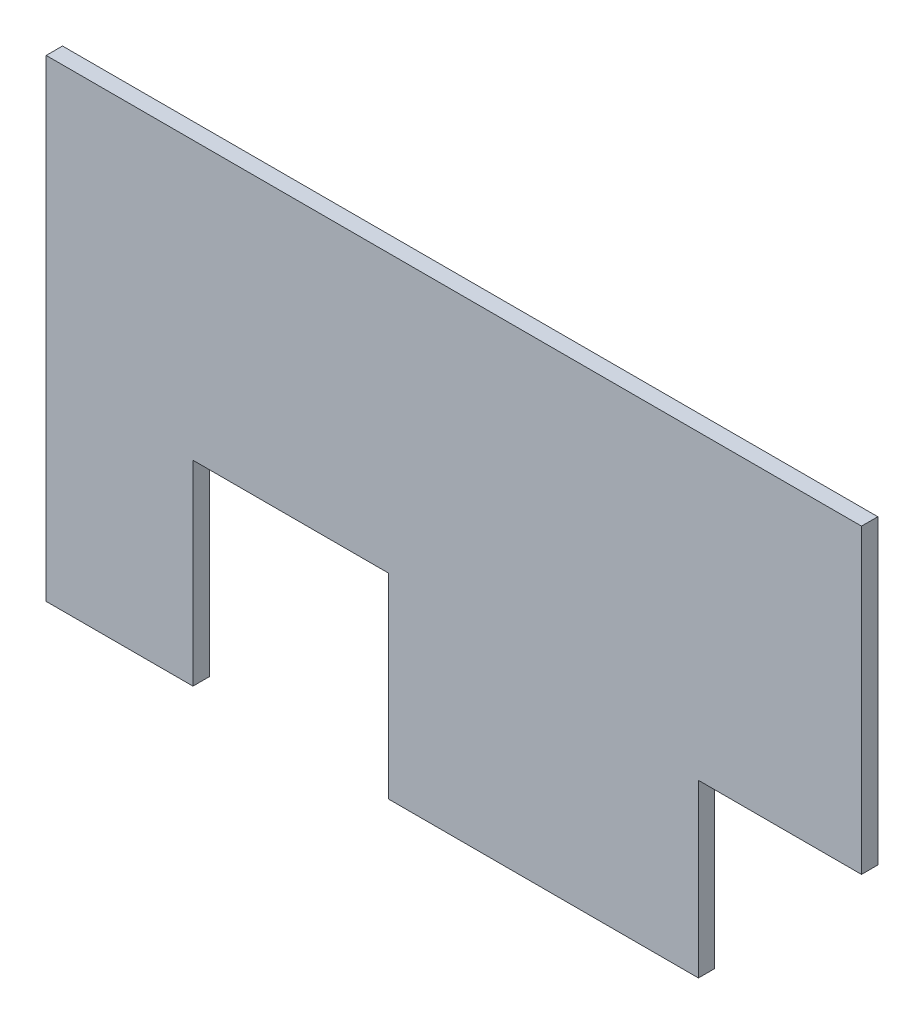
ISO-10303-21;
HEADER;
FILE_DESCRIPTION(('STEP AP214'),'2;1');
FILE_NAME('part.step','',(''),(''),'','','');
FILE_SCHEMA(('AUTOMOTIVE_DESIGN { 1 0 10303 214 1 1 1 1 }'));
ENDSEC;
DATA;
#1=APPLICATION_CONTEXT('core data for automotive mechanical design processes');
#2=APPLICATION_PROTOCOL_DEFINITION('international standard','automotive_design',2000,#1);
#3=PRODUCT_CONTEXT('',#1,'mechanical');
#4=PRODUCT('Part','Part','',(#3));
#5=PRODUCT_RELATED_PRODUCT_CATEGORY('part','',(#4));
#6=PRODUCT_DEFINITION_FORMATION('','',#4);
#7=PRODUCT_DEFINITION_CONTEXT('part definition',#1,'design');
#8=PRODUCT_DEFINITION('design','',#6,#7);
#9=PRODUCT_DEFINITION_SHAPE('','',#8);
#10=(LENGTH_UNIT() NAMED_UNIT(*) SI_UNIT(.MILLI.,.METRE.));
#11=(NAMED_UNIT(*) PLANE_ANGLE_UNIT() SI_UNIT($,.RADIAN.));
#12=(NAMED_UNIT(*) SI_UNIT($,.STERADIAN.) SOLID_ANGLE_UNIT());
#13=UNCERTAINTY_MEASURE_WITH_UNIT(LENGTH_MEASURE(1.E-05),#10,'distance_accuracy_value','');
#14=(GEOMETRIC_REPRESENTATION_CONTEXT(3) GLOBAL_UNCERTAINTY_ASSIGNED_CONTEXT((#13)) GLOBAL_UNIT_ASSIGNED_CONTEXT((#10,
#11,#12)) REPRESENTATION_CONTEXT('',''));
#15=CARTESIAN_POINT('',(0.,0.,0.));
#16=DIRECTION('',(0.,0.,1.));
#17=DIRECTION('',(1.,0.,0.));
#18=AXIS2_PLACEMENT_3D('',#15,#16,#17);
#19=CARTESIAN_POINT('',(0.,0.,1.));
#20=DIRECTION('',(0.,1.,0.));
#21=DIRECTION('',(0.,0.,1.));
#22=AXIS2_PLACEMENT_3D('',#19,#20,#21);
#23=PLANE('',#22);
#24=DIRECTION('',(1.,0.,0.));
#25=VECTOR('',#24,1.);
#26=CARTESIAN_POINT('',(0.,0.,0.));
#27=LINE('',#26,#25);
#28=CARTESIAN_POINT('',(0.,0.,0.));
#29=VERTEX_POINT('',#28);
#30=CARTESIAN_POINT('',(9.,0.,0.));
#31=VERTEX_POINT('',#30);
#32=EDGE_CURVE('E165',#29,#31,#27,.T.);
#33=ORIENTED_EDGE('',*,*,#32,.T.);
#34=DIRECTION('',(0.,0.,1.));
#35=VECTOR('',#34,1.);
#36=CARTESIAN_POINT('',(9.,0.,-0.5));
#37=LINE('',#36,#35);
#38=CARTESIAN_POINT('',(9.,0.,1.));
#39=VERTEX_POINT('',#38);
#40=EDGE_CURVE('E230',#31,#39,#37,.T.);
#41=ORIENTED_EDGE('',*,*,#40,.T.);
#42=DIRECTION('',(1.,0.,0.));
#43=VECTOR('',#42,1.);
#44=CARTESIAN_POINT('',(0.,0.,1.));
#45=LINE('',#44,#43);
#46=CARTESIAN_POINT('',(0.,0.,1.));
#47=VERTEX_POINT('',#46);
#48=EDGE_CURVE('E142',#47,#39,#45,.T.);
#49=ORIENTED_EDGE('',*,*,#48,.F.);
#50=DIRECTION('',(0.,0.,-1.));
#51=VECTOR('',#50,1.);
#52=CARTESIAN_POINT('',(0.,0.,1.));
#53=LINE('',#52,#51);
#54=EDGE_CURVE('E181',#47,#29,#53,.T.);
#55=ORIENTED_EDGE('',*,*,#54,.T.);
#56=EDGE_LOOP('',(#33,#41,#49,#55));
#57=FACE_BOUND('',#56,.T.);
#58=ADVANCED_FACE('F39',(#57),#23,.F.);
#59=CARTESIAN_POINT('',(0.,0.,1.));
#60=DIRECTION('',(1.,0.,0.));
#61=DIRECTION('',(0.,0.,-1.));
#62=AXIS2_PLACEMENT_3D('',#59,#60,#61);
#63=PLANE('',#62);
#64=DIRECTION('',(0.,-1.,0.));
#65=VECTOR('',#64,1.);
#66=CARTESIAN_POINT('',(0.,0.,0.));
#67=LINE('',#66,#65);
#68=CARTESIAN_POINT('',(0.,29.,0.));
#69=VERTEX_POINT('',#68);
#70=EDGE_CURVE('E160',#69,#29,#67,.T.);
#71=ORIENTED_EDGE('',*,*,#70,.T.);
#72=ORIENTED_EDGE('',*,*,#54,.F.);
#73=DIRECTION('',(0.,-1.,0.));
#74=VECTOR('',#73,1.);
#75=CARTESIAN_POINT('',(0.,0.,1.));
#76=LINE('',#75,#74);
#77=CARTESIAN_POINT('',(0.,29.,1.));
#78=VERTEX_POINT('',#77);
#79=EDGE_CURVE('E143',#78,#47,#76,.T.);
#80=ORIENTED_EDGE('',*,*,#79,.F.);
#81=DIRECTION('',(0.,0.,-1.));
#82=VECTOR('',#81,1.);
#83=CARTESIAN_POINT('',(0.,29.,1.));
#84=LINE('',#83,#82);
#85=EDGE_CURVE('E159',#78,#69,#84,.T.);
#86=ORIENTED_EDGE('',*,*,#85,.T.);
#87=EDGE_LOOP('',(#71,#72,#80,#86));
#88=FACE_BOUND('',#87,.T.);
#89=ADVANCED_FACE('F41',(#88),#63,.F.);
#90=CARTESIAN_POINT('',(21.,0.,0.));
#91=VERTEX_POINT('',#90);
#92=CARTESIAN_POINT('',(40.,0.,0.));
#93=VERTEX_POINT('',#92);
#94=EDGE_CURVE('E133',#91,#93,#27,.T.);
#95=ORIENTED_EDGE('',*,*,#94,.T.);
#96=DIRECTION('',(0.,0.,1.));
#97=VECTOR('',#96,1.);
#98=CARTESIAN_POINT('',(40.,0.,-0.5));
#99=LINE('',#98,#97);
#100=CARTESIAN_POINT('',(40.,0.,1.));
#101=VERTEX_POINT('',#100);
#102=EDGE_CURVE('E118',#93,#101,#99,.T.);
#103=ORIENTED_EDGE('',*,*,#102,.T.);
#104=CARTESIAN_POINT('',(21.,0.,1.));
#105=VERTEX_POINT('',#104);
#106=EDGE_CURVE('E131',#105,#101,#45,.T.);
#107=ORIENTED_EDGE('',*,*,#106,.F.);
#108=DIRECTION('',(0.,0.,1.));
#109=VECTOR('',#108,1.);
#110=CARTESIAN_POINT('',(21.,0.,-0.5));
#111=LINE('',#110,#109);
#112=EDGE_CURVE('E235',#91,#105,#111,.T.);
#113=ORIENTED_EDGE('',*,*,#112,.F.);
#114=EDGE_LOOP('',(#95,#103,#107,#113));
#115=FACE_BOUND('',#114,.T.);
#116=ADVANCED_FACE('F129',(#115),#23,.F.);
#117=CARTESIAN_POINT('',(50.,0.,1.));
#118=DIRECTION('',(-1.,0.,0.));
#119=DIRECTION('',(0.,0.,1.));
#120=AXIS2_PLACEMENT_3D('',#117,#118,#119);
#121=PLANE('',#120);
#122=DIRECTION('',(0.,1.,0.));
#123=VECTOR('',#122,1.);
#124=CARTESIAN_POINT('',(50.,0.,1.));
#125=LINE('',#124,#123);
#126=CARTESIAN_POINT('',(50.,10.5,1.));
#127=VERTEX_POINT('',#126);
#128=CARTESIAN_POINT('',(50.,29.,1.));
#129=VERTEX_POINT('',#128);
#130=EDGE_CURVE('E148',#127,#129,#125,.T.);
#131=ORIENTED_EDGE('',*,*,#130,.F.);
#132=DIRECTION('',(0.,0.,1.));
#133=VECTOR('',#132,1.);
#134=CARTESIAN_POINT('',(50.,10.5,-0.5));
#135=LINE('',#134,#133);
#136=CARTESIAN_POINT('',(50.,10.5,0.));
#137=VERTEX_POINT('',#136);
#138=EDGE_CURVE('E135',#137,#127,#135,.T.);
#139=ORIENTED_EDGE('',*,*,#138,.F.);
#140=DIRECTION('',(0.,1.,0.));
#141=VECTOR('',#140,1.);
#142=CARTESIAN_POINT('',(50.,0.,0.));
#143=LINE('',#142,#141);
#144=CARTESIAN_POINT('',(50.,29.,0.));
#145=VERTEX_POINT('',#144);
#146=EDGE_CURVE('E169',#137,#145,#143,.T.);
#147=ORIENTED_EDGE('',*,*,#146,.T.);
#148=DIRECTION('',(0.,0.,-1.));
#149=VECTOR('',#148,1.);
#150=CARTESIAN_POINT('',(50.,29.,1.));
#151=LINE('',#150,#149);
#152=EDGE_CURVE('E177',#129,#145,#151,.T.);
#153=ORIENTED_EDGE('',*,*,#152,.F.);
#154=EDGE_LOOP('',(#131,#139,#147,#153));
#155=FACE_BOUND('',#154,.T.);
#156=ADVANCED_FACE('F201',(#155),#121,.F.);
#157=CARTESIAN_POINT('',(0.,29.,1.));
#158=DIRECTION('',(0.,-1.,0.));
#159=DIRECTION('',(0.,0.,-1.));
#160=AXIS2_PLACEMENT_3D('',#157,#158,#159);
#161=PLANE('',#160);
#162=DIRECTION('',(-1.,0.,0.));
#163=VECTOR('',#162,1.);
#164=CARTESIAN_POINT('',(0.,29.,0.));
#165=LINE('',#164,#163);
#166=EDGE_CURVE('E150',#145,#69,#165,.T.);
#167=ORIENTED_EDGE('',*,*,#166,.T.);
#168=ORIENTED_EDGE('',*,*,#85,.F.);
#169=DIRECTION('',(-1.,0.,0.));
#170=VECTOR('',#169,1.);
#171=CARTESIAN_POINT('',(0.,29.,1.));
#172=LINE('',#171,#170);
#173=EDGE_CURVE('E156',#129,#78,#172,.T.);
#174=ORIENTED_EDGE('',*,*,#173,.F.);
#175=ORIENTED_EDGE('',*,*,#152,.T.);
#176=EDGE_LOOP('',(#167,#168,#174,#175));
#177=FACE_BOUND('',#176,.T.);
#178=ADVANCED_FACE('F210',(#177),#161,.F.);
#179=CARTESIAN_POINT('',(0.,0.,1.));
#180=DIRECTION('',(0.,0.,-1.));
#181=DIRECTION('',(-1.,0.,0.));
#182=AXIS2_PLACEMENT_3D('',#179,#180,#181);
#183=PLANE('',#182);
#184=ORIENTED_EDGE('',*,*,#106,.T.);
#185=DIRECTION('',(0.,-1.,0.));
#186=VECTOR('',#185,1.);
#187=CARTESIAN_POINT('',(40.,0.,1.));
#188=LINE('',#187,#186);
#189=CARTESIAN_POINT('',(40.,10.5,1.));
#190=VERTEX_POINT('',#189);
#191=EDGE_CURVE('E115',#190,#101,#188,.T.);
#192=ORIENTED_EDGE('',*,*,#191,.F.);
#193=DIRECTION('',(-1.,0.,0.));
#194=VECTOR('',#193,1.);
#195=CARTESIAN_POINT('',(40.,10.5,1.));
#196=LINE('',#195,#194);
#197=EDGE_CURVE('E124',#127,#190,#196,.T.);
#198=ORIENTED_EDGE('',*,*,#197,.F.);
#199=ORIENTED_EDGE('',*,*,#130,.T.);
#200=ORIENTED_EDGE('',*,*,#173,.T.);
#201=ORIENTED_EDGE('',*,*,#79,.T.);
#202=ORIENTED_EDGE('',*,*,#48,.T.);
#203=DIRECTION('',(0.,-1.,0.));
#204=VECTOR('',#203,1.);
#205=CARTESIAN_POINT('',(9.,0.,1.));
#206=LINE('',#205,#204);
#207=CARTESIAN_POINT('',(9.,12.,1.));
#208=VERTEX_POINT('',#207);
#209=EDGE_CURVE('E220',#208,#39,#206,.T.);
#210=ORIENTED_EDGE('',*,*,#209,.F.);
#211=DIRECTION('',(-1.,0.,0.));
#212=VECTOR('',#211,1.);
#213=CARTESIAN_POINT('',(9.,12.,1.));
#214=LINE('',#213,#212);
#215=CARTESIAN_POINT('',(21.,12.,1.));
#216=VERTEX_POINT('',#215);
#217=EDGE_CURVE('E226',#216,#208,#214,.T.);
#218=ORIENTED_EDGE('',*,*,#217,.F.);
#219=DIRECTION('',(0.,1.,0.));
#220=VECTOR('',#219,1.);
#221=CARTESIAN_POINT('',(21.,0.,1.));
#222=LINE('',#221,#220);
#223=EDGE_CURVE('E140',#105,#216,#222,.T.);
#224=ORIENTED_EDGE('',*,*,#223,.F.);
#225=EDGE_LOOP('',(#184,#192,#198,#199,#200,#201,#202,#210,#218,#224));
#226=FACE_BOUND('',#225,.T.);
#227=ADVANCED_FACE('F138',(#226),#183,.F.);
#228=CARTESIAN_POINT('',(0.,0.,0.));
#229=DIRECTION('',(0.,0.,-1.));
#230=DIRECTION('',(-1.,0.,0.));
#231=AXIS2_PLACEMENT_3D('',#228,#229,#230);
#232=PLANE('',#231);
#233=DIRECTION('',(0.,1.,0.));
#234=VECTOR('',#233,1.);
#235=CARTESIAN_POINT('',(40.,0.,0.));
#236=LINE('',#235,#234);
#237=CARTESIAN_POINT('',(40.,10.5,0.));
#238=VERTEX_POINT('',#237);
#239=EDGE_CURVE('E11',#93,#238,#236,.T.);
#240=ORIENTED_EDGE('',*,*,#239,.F.);
#241=ORIENTED_EDGE('',*,*,#94,.F.);
#242=DIRECTION('',(0.,-1.,0.));
#243=VECTOR('',#242,1.);
#244=CARTESIAN_POINT('',(21.,0.,0.));
#245=LINE('',#244,#243);
#246=CARTESIAN_POINT('',(21.,12.,0.));
#247=VERTEX_POINT('',#246);
#248=EDGE_CURVE('E185',#247,#91,#245,.T.);
#249=ORIENTED_EDGE('',*,*,#248,.F.);
#250=DIRECTION('',(1.,0.,0.));
#251=VECTOR('',#250,1.);
#252=CARTESIAN_POINT('',(0.,12.,0.));
#253=LINE('',#252,#251);
#254=CARTESIAN_POINT('',(9.,12.,0.));
#255=VERTEX_POINT('',#254);
#256=EDGE_CURVE('E188',#255,#247,#253,.T.);
#257=ORIENTED_EDGE('',*,*,#256,.F.);
#258=DIRECTION('',(0.,1.,0.));
#259=VECTOR('',#258,1.);
#260=CARTESIAN_POINT('',(9.,0.,0.));
#261=LINE('',#260,#259);
#262=EDGE_CURVE('E191',#31,#255,#261,.T.);
#263=ORIENTED_EDGE('',*,*,#262,.F.);
#264=ORIENTED_EDGE('',*,*,#32,.F.);
#265=ORIENTED_EDGE('',*,*,#70,.F.);
#266=ORIENTED_EDGE('',*,*,#166,.F.);
#267=ORIENTED_EDGE('',*,*,#146,.F.);
#268=DIRECTION('',(1.,0.,0.));
#269=VECTOR('',#268,1.);
#270=CARTESIAN_POINT('',(0.,10.5,0.));
#271=LINE('',#270,#269);
#272=EDGE_CURVE('E48',#238,#137,#271,.T.);
#273=ORIENTED_EDGE('',*,*,#272,.F.);
#274=EDGE_LOOP('',(#240,#241,#249,#257,#263,#264,#265,#266,#267,#273));
#275=FACE_BOUND('',#274,.T.);
#276=ADVANCED_FACE('F206',(#275),#232,.T.);
#277=CARTESIAN_POINT('',(9.,0.,-0.5));
#278=DIRECTION('',(-1.,0.,0.));
#279=DIRECTION('',(0.,0.,1.));
#280=AXIS2_PLACEMENT_3D('',#277,#278,#279);
#281=PLANE('',#280);
#282=ORIENTED_EDGE('',*,*,#262,.T.);
#283=DIRECTION('',(0.,0.,1.));
#284=VECTOR('',#283,1.);
#285=CARTESIAN_POINT('',(9.,12.,-0.5));
#286=LINE('',#285,#284);
#287=EDGE_CURVE('E164',#255,#208,#286,.T.);
#288=ORIENTED_EDGE('',*,*,#287,.T.);
#289=ORIENTED_EDGE('',*,*,#209,.T.);
#290=ORIENTED_EDGE('',*,*,#40,.F.);
#291=EDGE_LOOP('',(#282,#288,#289,#290));
#292=FACE_BOUND('',#291,.T.);
#293=ADVANCED_FACE('F242',(#292),#281,.F.);
#294=CARTESIAN_POINT('',(9.,12.,-0.5));
#295=DIRECTION('',(0.,1.,0.));
#296=DIRECTION('',(0.,0.,1.));
#297=AXIS2_PLACEMENT_3D('',#294,#295,#296);
#298=PLANE('',#297);
#299=ORIENTED_EDGE('',*,*,#256,.T.);
#300=DIRECTION('',(0.,0.,1.));
#301=VECTOR('',#300,1.);
#302=CARTESIAN_POINT('',(21.,12.,-0.5));
#303=LINE('',#302,#301);
#304=EDGE_CURVE('E62',#247,#216,#303,.T.);
#305=ORIENTED_EDGE('',*,*,#304,.T.);
#306=ORIENTED_EDGE('',*,*,#217,.T.);
#307=ORIENTED_EDGE('',*,*,#287,.F.);
#308=EDGE_LOOP('',(#299,#305,#306,#307));
#309=FACE_BOUND('',#308,.T.);
#310=ADVANCED_FACE('F247',(#309),#298,.F.);
#311=CARTESIAN_POINT('',(21.,0.,-0.5));
#312=DIRECTION('',(1.,0.,0.));
#313=DIRECTION('',(0.,0.,-1.));
#314=AXIS2_PLACEMENT_3D('',#311,#312,#313);
#315=PLANE('',#314);
#316=ORIENTED_EDGE('',*,*,#248,.T.);
#317=ORIENTED_EDGE('',*,*,#112,.T.);
#318=ORIENTED_EDGE('',*,*,#223,.T.);
#319=ORIENTED_EDGE('',*,*,#304,.F.);
#320=EDGE_LOOP('',(#316,#317,#318,#319));
#321=FACE_BOUND('',#320,.T.);
#322=ADVANCED_FACE('F248',(#321),#315,.F.);
#323=CARTESIAN_POINT('',(40.,0.,-0.5));
#324=DIRECTION('',(-1.,0.,0.));
#325=DIRECTION('',(0.,0.,1.));
#326=AXIS2_PLACEMENT_3D('',#323,#324,#325);
#327=PLANE('',#326);
#328=ORIENTED_EDGE('',*,*,#239,.T.);
#329=DIRECTION('',(0.,0.,1.));
#330=VECTOR('',#329,1.);
#331=CARTESIAN_POINT('',(40.,10.5,-0.5));
#332=LINE('',#331,#330);
#333=EDGE_CURVE('E55',#238,#190,#332,.T.);
#334=ORIENTED_EDGE('',*,*,#333,.T.);
#335=ORIENTED_EDGE('',*,*,#191,.T.);
#336=ORIENTED_EDGE('',*,*,#102,.F.);
#337=EDGE_LOOP('',(#328,#334,#335,#336));
#338=FACE_BOUND('',#337,.T.);
#339=ADVANCED_FACE('F117',(#338),#327,.F.);
#340=CARTESIAN_POINT('',(40.,10.5,-0.5));
#341=DIRECTION('',(0.,1.,0.));
#342=DIRECTION('',(0.,0.,1.));
#343=AXIS2_PLACEMENT_3D('',#340,#341,#342);
#344=PLANE('',#343);
#345=ORIENTED_EDGE('',*,*,#272,.T.);
#346=ORIENTED_EDGE('',*,*,#138,.T.);
#347=ORIENTED_EDGE('',*,*,#197,.T.);
#348=ORIENTED_EDGE('',*,*,#333,.F.);
#349=EDGE_LOOP('',(#345,#346,#347,#348));
#350=FACE_BOUND('',#349,.T.);
#351=ADVANCED_FACE('F196',(#350),#344,.F.);
#352=CLOSED_SHELL('',(#58,#89,#116,#156,#178,#227,#276,#293,#310,#322,#339,#351));
#353=MANIFOLD_SOLID_BREP('B2',#352);
#354=ADVANCED_BREP_SHAPE_REPRESENTATION('',(#18,#353),#14);
#355=SHAPE_DEFINITION_REPRESENTATION(#9,#354);
ENDSEC;
END-ISO-10303-21;
